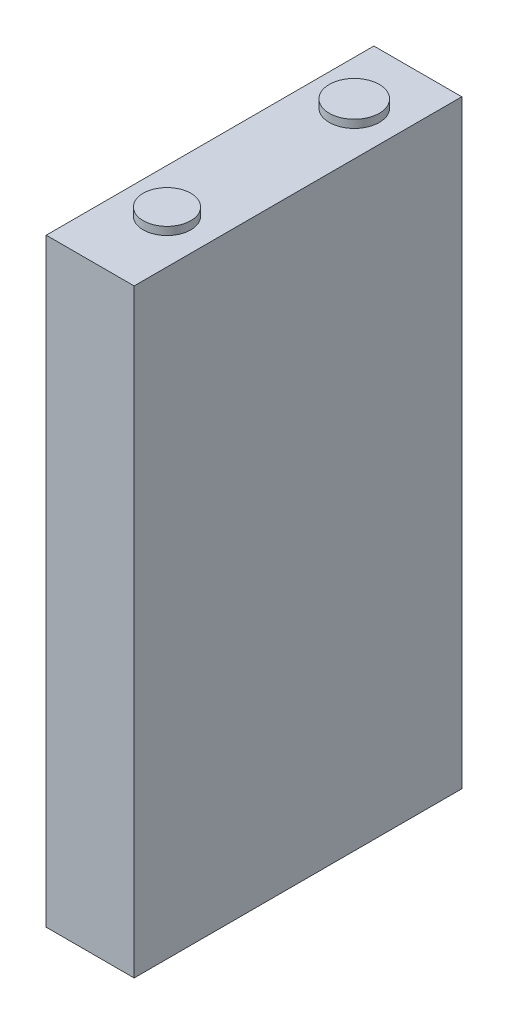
from build123d import *

# Parameters (mm, degrees)
SKETCH1_W           = 130.175
SKETCH1_H           = 238.125
BOSS_EXTRUDE1_DEPTH = 17.4625
SKETCH2_R           = 9.931033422
SKETCH2_R_2         = 9.445963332
BOSS_EXTRUDE2_DEPTH = 3.175


with BuildPart() as part:
    # Sketch1 → Boss-Extrude1 (new, symmetric)
    with BuildSketch(Plane(origin=(0, 0, 0), x_dir=(0, 0, -1), z_dir=(1, 0, 0))):
        Rectangle(SKETCH1_W, SKETCH1_H)
    extrude(amount=BOSS_EXTRUDE1_DEPTH, both=True)

    # Sketch2 → Boss-Extrude2 (add, symmetric)
    with BuildSketch(Plane(origin=(0, 119.0625, 0), x_dir=(1, 0, 0), z_dir=(0, 1, 0))):
        with Locations(Location((0, 39.841017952, 0), (0, 0, 90))):
            Circle(SKETCH2_R)
        with Locations(Location((0, -34.565266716, 0), (0, 0, 90))):
            Circle(SKETCH2_R_2)
    extrude(amount=BOSS_EXTRUDE2_DEPTH, both=True)


solid = part.part
